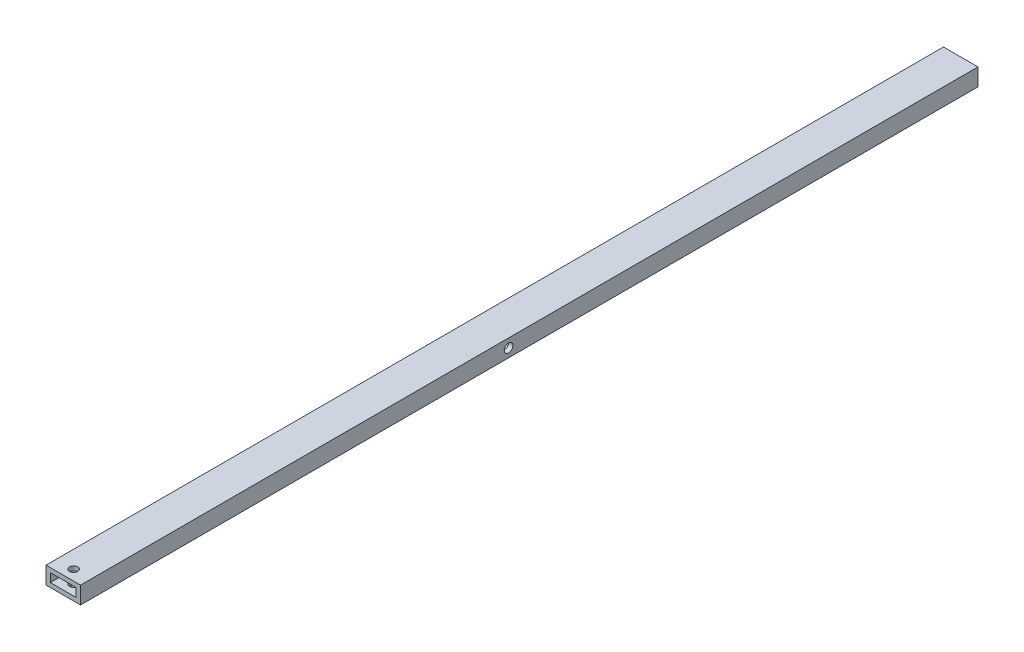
ISO-10303-21;
HEADER;
FILE_DESCRIPTION(('STEP AP214'),'2;1');
FILE_NAME('part.step','',(''),(''),'','','');
FILE_SCHEMA(('AUTOMOTIVE_DESIGN { 1 0 10303 214 1 1 1 1 }'));
ENDSEC;
DATA;
#1=APPLICATION_CONTEXT('core data for automotive mechanical design processes');
#2=APPLICATION_PROTOCOL_DEFINITION('international standard','automotive_design',2000,#1);
#3=PRODUCT_CONTEXT('',#1,'mechanical');
#4=PRODUCT('Part','Part','',(#3));
#5=PRODUCT_RELATED_PRODUCT_CATEGORY('part','',(#4));
#6=PRODUCT_DEFINITION_FORMATION('','',#4);
#7=PRODUCT_DEFINITION_CONTEXT('part definition',#1,'design');
#8=PRODUCT_DEFINITION('design','',#6,#7);
#9=PRODUCT_DEFINITION_SHAPE('','',#8);
#10=(LENGTH_UNIT() NAMED_UNIT(*) SI_UNIT(.MILLI.,.METRE.));
#11=(NAMED_UNIT(*) PLANE_ANGLE_UNIT() SI_UNIT($,.RADIAN.));
#12=(NAMED_UNIT(*) SI_UNIT($,.STERADIAN.) SOLID_ANGLE_UNIT());
#13=UNCERTAINTY_MEASURE_WITH_UNIT(LENGTH_MEASURE(1.E-05),#10,'distance_accuracy_value','');
#14=(GEOMETRIC_REPRESENTATION_CONTEXT(3) GLOBAL_UNCERTAINTY_ASSIGNED_CONTEXT((#13)) GLOBAL_UNIT_ASSIGNED_CONTEXT((#10,
#11,#12)) REPRESENTATION_CONTEXT('',''));
#15=CARTESIAN_POINT('',(0.,0.,0.));
#16=DIRECTION('',(0.,0.,1.));
#17=DIRECTION('',(1.,0.,0.));
#18=AXIS2_PLACEMENT_3D('',#15,#16,#17);
#19=CARTESIAN_POINT('',(-6.35,3.175,304.8));
#20=DIRECTION('',(1.,0.,0.));
#21=DIRECTION('',(0.,0.,-1.));
#22=AXIS2_PLACEMENT_3D('',#19,#20,#21);
#23=PLANE('',#22);
#24=CARTESIAN_POINT('',(-6.35,0.,147.32));
#25=DIRECTION('',(1.,0.,0.));
#26=DIRECTION('',(0.,1.,0.));
#27=AXIS2_PLACEMENT_3D('',#24,#25,#26);
#28=CIRCLE('',#27,1.58749999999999);
#29=CARTESIAN_POINT('',(-6.35,1.58749999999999,147.32));
#30=VERTEX_POINT('',#29);
#31=EDGE_CURVE('E210',#30,#30,#28,.T.);
#32=ORIENTED_EDGE('',*,*,#31,.T.);
#33=EDGE_LOOP('',(#32));
#34=FACE_BOUND('',#33,.T.);
#35=DIRECTION('',(0.,1.,0.));
#36=VECTOR('',#35,1.);
#37=CARTESIAN_POINT('',(-6.35,-3.175,-25.4));
#38=LINE('',#37,#36);
#39=CARTESIAN_POINT('',(-6.35,-3.175,-25.4));
#40=VERTEX_POINT('',#39);
#41=CARTESIAN_POINT('',(-6.35,3.175,-25.4));
#42=VERTEX_POINT('',#41);
#43=EDGE_CURVE('E55',#40,#42,#38,.T.);
#44=ORIENTED_EDGE('',*,*,#43,.F.);
#45=DIRECTION('',(0.,0.,-1.));
#46=VECTOR('',#45,1.);
#47=CARTESIAN_POINT('',(-6.35,-3.175,304.8));
#48=LINE('',#47,#46);
#49=CARTESIAN_POINT('',(-6.35,-3.175,304.8));
#50=VERTEX_POINT('',#49);
#51=EDGE_CURVE('E48',#50,#40,#48,.T.);
#52=ORIENTED_EDGE('',*,*,#51,.F.);
#53=DIRECTION('',(0.,-1.,0.));
#54=VECTOR('',#53,1.);
#55=CARTESIAN_POINT('',(-6.35,3.175,304.8));
#56=LINE('',#55,#54);
#57=CARTESIAN_POINT('',(-6.35,3.175,304.8));
#58=VERTEX_POINT('',#57);
#59=EDGE_CURVE('E185',#58,#50,#56,.T.);
#60=ORIENTED_EDGE('',*,*,#59,.F.);
#61=DIRECTION('',(0.,0.,-1.));
#62=VECTOR('',#61,1.);
#63=CARTESIAN_POINT('',(-6.35,3.175,304.8));
#64=LINE('',#63,#62);
#65=EDGE_CURVE('E137',#58,#42,#64,.T.);
#66=ORIENTED_EDGE('',*,*,#65,.T.);
#67=EDGE_LOOP('',(#44,#52,#60,#66));
#68=FACE_BOUND('',#67,.T.);
#69=ADVANCED_FACE('F41',(#34,#68),#23,.F.);
#70=CARTESIAN_POINT('',(-6.35,-3.175,304.8));
#71=DIRECTION('',(0.,1.,0.));
#72=DIRECTION('',(-1.,0.,0.));
#73=AXIS2_PLACEMENT_3D('',#70,#71,#72);
#74=PLANE('',#73);
#75=CARTESIAN_POINT('',(0.,-3.175,300.99));
#76=DIRECTION('',(0.,1.,0.));
#77=DIRECTION('',(0.,0.,1.));
#78=AXIS2_PLACEMENT_3D('',#75,#76,#77);
#79=CIRCLE('',#78,1.5);
#80=CARTESIAN_POINT('',(0.,-3.175,302.49));
#81=VERTEX_POINT('',#80);
#82=EDGE_CURVE('E143',#81,#81,#79,.T.);
#83=ORIENTED_EDGE('',*,*,#82,.T.);
#84=EDGE_LOOP('',(#83));
#85=FACE_BOUND('',#84,.T.);
#86=DIRECTION('',(-1.,0.,0.));
#87=VECTOR('',#86,1.);
#88=CARTESIAN_POINT('',(-6.35,-3.175,-25.4));
#89=LINE('',#88,#87);
#90=CARTESIAN_POINT('',(6.35,-3.175,-25.4));
#91=VERTEX_POINT('',#90);
#92=EDGE_CURVE('E117',#91,#40,#89,.T.);
#93=ORIENTED_EDGE('',*,*,#92,.F.);
#94=DIRECTION('',(0.,0.,-1.));
#95=VECTOR('',#94,1.);
#96=CARTESIAN_POINT('',(6.35,-3.175,304.8));
#97=LINE('',#96,#95);
#98=CARTESIAN_POINT('',(6.35,-3.175,304.8));
#99=VERTEX_POINT('',#98);
#100=EDGE_CURVE('E128',#99,#91,#97,.T.);
#101=ORIENTED_EDGE('',*,*,#100,.F.);
#102=DIRECTION('',(1.,0.,0.));
#103=VECTOR('',#102,1.);
#104=CARTESIAN_POINT('',(-6.35,-3.175,304.8));
#105=LINE('',#104,#103);
#106=EDGE_CURVE('E188',#50,#99,#105,.T.);
#107=ORIENTED_EDGE('',*,*,#106,.F.);
#108=ORIENTED_EDGE('',*,*,#51,.T.);
#109=EDGE_LOOP('',(#93,#101,#107,#108));
#110=FACE_BOUND('',#109,.T.);
#111=ADVANCED_FACE('F127',(#85,#110),#74,.F.);
#112=CARTESIAN_POINT('',(6.35,-3.175,304.8));
#113=DIRECTION('',(-1.,0.,0.));
#114=DIRECTION('',(0.,-1.,0.));
#115=AXIS2_PLACEMENT_3D('',#112,#113,#114);
#116=PLANE('',#115);
#117=CARTESIAN_POINT('',(6.35,0.,147.32));
#118=DIRECTION('',(1.,0.,0.));
#119=DIRECTION('',(0.,1.,0.));
#120=AXIS2_PLACEMENT_3D('',#117,#118,#119);
#121=CIRCLE('',#120,1.58749999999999);
#122=CARTESIAN_POINT('',(6.35,1.58749999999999,147.32));
#123=VERTEX_POINT('',#122);
#124=EDGE_CURVE('E209',#123,#123,#121,.T.);
#125=ORIENTED_EDGE('',*,*,#124,.F.);
#126=EDGE_LOOP('',(#125));
#127=FACE_BOUND('',#126,.T.);
#128=DIRECTION('',(0.,-1.,0.));
#129=VECTOR('',#128,1.);
#130=CARTESIAN_POINT('',(6.35,-3.175,-25.4));
#131=LINE('',#130,#129);
#132=CARTESIAN_POINT('',(6.35,3.175,-25.4));
#133=VERTEX_POINT('',#132);
#134=EDGE_CURVE('E114',#133,#91,#131,.T.);
#135=ORIENTED_EDGE('',*,*,#134,.F.);
#136=DIRECTION('',(0.,0.,-1.));
#137=VECTOR('',#136,1.);
#138=CARTESIAN_POINT('',(6.35,3.175,304.8));
#139=LINE('',#138,#137);
#140=CARTESIAN_POINT('',(6.35,3.175,304.8));
#141=VERTEX_POINT('',#140);
#142=EDGE_CURVE('E134',#141,#133,#139,.T.);
#143=ORIENTED_EDGE('',*,*,#142,.F.);
#144=DIRECTION('',(0.,1.,0.));
#145=VECTOR('',#144,1.);
#146=CARTESIAN_POINT('',(6.35,-3.175,304.8));
#147=LINE('',#146,#145);
#148=EDGE_CURVE('E133',#99,#141,#147,.T.);
#149=ORIENTED_EDGE('',*,*,#148,.F.);
#150=ORIENTED_EDGE('',*,*,#100,.T.);
#151=EDGE_LOOP('',(#135,#143,#149,#150));
#152=FACE_BOUND('',#151,.T.);
#153=ADVANCED_FACE('F132',(#127,#152),#116,.F.);
#154=CARTESIAN_POINT('',(6.35,3.175,304.8));
#155=DIRECTION('',(0.,-1.,0.));
#156=DIRECTION('',(0.,0.,-1.));
#157=AXIS2_PLACEMENT_3D('',#154,#155,#156);
#158=PLANE('',#157);
#159=CARTESIAN_POINT('',(0.,3.175,300.99));
#160=DIRECTION('',(0.,1.,0.));
#161=DIRECTION('',(0.,0.,1.));
#162=AXIS2_PLACEMENT_3D('',#159,#160,#161);
#163=CIRCLE('',#162,1.5);
#164=CARTESIAN_POINT('',(0.,3.175,302.49));
#165=VERTEX_POINT('',#164);
#166=EDGE_CURVE('E150',#165,#165,#163,.T.);
#167=ORIENTED_EDGE('',*,*,#166,.F.);
#168=EDGE_LOOP('',(#167));
#169=FACE_BOUND('',#168,.T.);
#170=DIRECTION('',(1.,0.,0.));
#171=VECTOR('',#170,1.);
#172=CARTESIAN_POINT('',(-6.35,3.175,-25.4));
#173=LINE('',#172,#171);
#174=EDGE_CURVE('E118',#42,#133,#173,.T.);
#175=ORIENTED_EDGE('',*,*,#174,.F.);
#176=ORIENTED_EDGE('',*,*,#65,.F.);
#177=DIRECTION('',(-1.,0.,0.));
#178=VECTOR('',#177,1.);
#179=CARTESIAN_POINT('',(6.35,3.175,304.8));
#180=LINE('',#179,#178);
#181=EDGE_CURVE('E191',#141,#58,#180,.T.);
#182=ORIENTED_EDGE('',*,*,#181,.F.);
#183=ORIENTED_EDGE('',*,*,#142,.T.);
#184=EDGE_LOOP('',(#175,#176,#182,#183));
#185=FACE_BOUND('',#184,.T.);
#186=ADVANCED_FACE('F198',(#169,#185),#158,.F.);
#187=CARTESIAN_POINT('',(-4.7625,1.5875,304.8));
#188=DIRECTION('',(1.,0.,0.));
#189=DIRECTION('',(0.,1.,0.));
#190=AXIS2_PLACEMENT_3D('',#187,#188,#189);
#191=PLANE('',#190);
#192=DIRECTION('',(0.,0.,-1.));
#193=VECTOR('',#192,1.);
#194=CARTESIAN_POINT('',(-4.7625,-1.5875,304.8));
#195=LINE('',#194,#193);
#196=CARTESIAN_POINT('',(-4.7625,-1.5875,147.32));
#197=VERTEX_POINT('',#196);
#198=CARTESIAN_POINT('',(-4.7625,-1.5875,-25.4));
#199=VERTEX_POINT('',#198);
#200=EDGE_CURVE('E181',#197,#199,#195,.T.);
#201=ORIENTED_EDGE('',*,*,#200,.T.);
#202=DIRECTION('',(0.,1.,0.));
#203=VECTOR('',#202,1.);
#204=CARTESIAN_POINT('',(-4.7625,1.5875,-25.4));
#205=LINE('',#204,#203);
#206=CARTESIAN_POINT('',(-4.7625,1.5875,-25.4));
#207=VERTEX_POINT('',#206);
#208=EDGE_CURVE('E206',#199,#207,#205,.T.);
#209=ORIENTED_EDGE('',*,*,#208,.T.);
#210=DIRECTION('',(0.,0.,-1.));
#211=VECTOR('',#210,1.);
#212=CARTESIAN_POINT('',(-4.7625,1.5875,304.8));
#213=LINE('',#212,#211);
#214=CARTESIAN_POINT('',(-4.7625,1.58749999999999,147.32));
#215=VERTEX_POINT('',#214);
#216=EDGE_CURVE('E169',#215,#207,#213,.T.);
#217=ORIENTED_EDGE('',*,*,#216,.F.);
#218=CARTESIAN_POINT('',(-4.7625,0.,147.32));
#219=DIRECTION('',(1.,0.,0.));
#220=DIRECTION('',(0.,1.,0.));
#221=AXIS2_PLACEMENT_3D('',#218,#219,#220);
#222=CIRCLE('',#221,1.58749999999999);
#223=EDGE_CURVE('E158',#197,#215,#222,.T.);
#224=ORIENTED_EDGE('',*,*,#223,.F.);
#225=EDGE_LOOP('',(#201,#209,#217,#224));
#226=FACE_BOUND('',#225,.T.);
#227=ADVANCED_FACE('F230',(#226),#191,.T.);
#228=CARTESIAN_POINT('',(-4.7625,-1.5875,304.8));
#229=DIRECTION('',(0.,1.,0.));
#230=DIRECTION('',(0.,0.,1.));
#231=AXIS2_PLACEMENT_3D('',#228,#229,#230);
#232=PLANE('',#231);
#233=CARTESIAN_POINT('',(0.,-1.5875,300.99));
#234=DIRECTION('',(0.,1.,0.));
#235=DIRECTION('',(0.,0.,1.));
#236=AXIS2_PLACEMENT_3D('',#233,#234,#235);
#237=CIRCLE('',#236,1.5);
#238=CARTESIAN_POINT('',(0.,-1.5875,302.49));
#239=VERTEX_POINT('',#238);
#240=EDGE_CURVE('E142',#239,#239,#237,.T.);
#241=ORIENTED_EDGE('',*,*,#240,.F.);
#242=EDGE_LOOP('',(#241));
#243=FACE_BOUND('',#242,.T.);
#244=DIRECTION('',(0.,0.,-1.));
#245=VECTOR('',#244,1.);
#246=CARTESIAN_POINT('',(4.76250000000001,-1.5875,304.8));
#247=LINE('',#246,#245);
#248=CARTESIAN_POINT('',(4.76250000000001,-1.5875,147.32));
#249=VERTEX_POINT('',#248);
#250=CARTESIAN_POINT('',(4.76250000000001,-1.5875,-25.4));
#251=VERTEX_POINT('',#250);
#252=EDGE_CURVE('E177',#249,#251,#247,.T.);
#253=ORIENTED_EDGE('',*,*,#252,.T.);
#254=DIRECTION('',(-1.,0.,0.));
#255=VECTOR('',#254,1.);
#256=CARTESIAN_POINT('',(-4.7625,-1.5875,-25.4));
#257=LINE('',#256,#255);
#258=EDGE_CURVE('E200',#251,#199,#257,.T.);
#259=ORIENTED_EDGE('',*,*,#258,.T.);
#260=ORIENTED_EDGE('',*,*,#200,.F.);
#261=CARTESIAN_POINT('',(-4.7625,-1.5875,304.8));
#262=VERTEX_POINT('',#261);
#263=EDGE_CURVE('E182',#262,#197,#195,.T.);
#264=ORIENTED_EDGE('',*,*,#263,.F.);
#265=DIRECTION('',(1.,0.,0.));
#266=VECTOR('',#265,1.);
#267=CARTESIAN_POINT('',(-4.7625,-1.5875,304.8));
#268=LINE('',#267,#266);
#269=CARTESIAN_POINT('',(4.76250000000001,-1.5875,304.8));
#270=VERTEX_POINT('',#269);
#271=EDGE_CURVE('E162',#262,#270,#268,.T.);
#272=ORIENTED_EDGE('',*,*,#271,.T.);
#273=EDGE_CURVE('E178',#270,#249,#247,.T.);
#274=ORIENTED_EDGE('',*,*,#273,.T.);
#275=EDGE_LOOP('',(#253,#259,#260,#264,#272,#274));
#276=FACE_BOUND('',#275,.T.);
#277=ADVANCED_FACE('F235',(#243,#276),#232,.T.);
#278=CARTESIAN_POINT('',(4.76250000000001,-1.5875,304.8));
#279=DIRECTION('',(-1.,0.,0.));
#280=DIRECTION('',(0.,-1.,0.));
#281=AXIS2_PLACEMENT_3D('',#278,#279,#280);
#282=PLANE('',#281);
#283=DIRECTION('',(0.,0.,-1.));
#284=VECTOR('',#283,1.);
#285=CARTESIAN_POINT('',(4.76250000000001,1.5875,304.8));
#286=LINE('',#285,#284);
#287=CARTESIAN_POINT('',(4.76250000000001,1.5875,147.32));
#288=VERTEX_POINT('',#287);
#289=CARTESIAN_POINT('',(4.76250000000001,1.5875,-25.4));
#290=VERTEX_POINT('',#289);
#291=EDGE_CURVE('E173',#288,#290,#286,.T.);
#292=ORIENTED_EDGE('',*,*,#291,.T.);
#293=DIRECTION('',(0.,-1.,0.));
#294=VECTOR('',#293,1.);
#295=CARTESIAN_POINT('',(4.76250000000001,-1.5875,-25.4));
#296=LINE('',#295,#294);
#297=EDGE_CURVE('E63',#290,#251,#296,.T.);
#298=ORIENTED_EDGE('',*,*,#297,.T.);
#299=ORIENTED_EDGE('',*,*,#252,.F.);
#300=CARTESIAN_POINT('',(4.76250000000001,0.,147.32));
#301=DIRECTION('',(-1.,0.,0.));
#302=DIRECTION('',(0.,-1.,0.));
#303=AXIS2_PLACEMENT_3D('',#300,#301,#302);
#304=CIRCLE('',#303,1.58749999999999);
#305=EDGE_CURVE('E213',#288,#249,#304,.T.);
#306=ORIENTED_EDGE('',*,*,#305,.F.);
#307=EDGE_LOOP('',(#292,#298,#299,#306));
#308=FACE_BOUND('',#307,.T.);
#309=ADVANCED_FACE('F249',(#308),#282,.T.);
#310=CARTESIAN_POINT('',(4.76250000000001,1.5875,304.8));
#311=DIRECTION('',(0.,-1.,0.));
#312=DIRECTION('',(0.,0.,-1.));
#313=AXIS2_PLACEMENT_3D('',#310,#311,#312);
#314=PLANE('',#313);
#315=CARTESIAN_POINT('',(0.,1.5875,300.99));
#316=DIRECTION('',(0.,-1.,0.));
#317=DIRECTION('',(0.,0.,-1.));
#318=AXIS2_PLACEMENT_3D('',#315,#316,#317);
#319=CIRCLE('',#318,1.5);
#320=CARTESIAN_POINT('',(0.,1.5875,299.49));
#321=VERTEX_POINT('',#320);
#322=EDGE_CURVE('E140',#321,#321,#319,.T.);
#323=ORIENTED_EDGE('',*,*,#322,.F.);
#324=EDGE_LOOP('',(#323));
#325=FACE_BOUND('',#324,.T.);
#326=ORIENTED_EDGE('',*,*,#216,.T.);
#327=DIRECTION('',(1.,0.,0.));
#328=VECTOR('',#327,1.);
#329=CARTESIAN_POINT('',(4.76250000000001,1.5875,-25.4));
#330=LINE('',#329,#328);
#331=EDGE_CURVE('E11',#207,#290,#330,.T.);
#332=ORIENTED_EDGE('',*,*,#331,.T.);
#333=ORIENTED_EDGE('',*,*,#291,.F.);
#334=CARTESIAN_POINT('',(4.76250000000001,1.5875,304.8));
#335=VERTEX_POINT('',#334);
#336=EDGE_CURVE('E174',#335,#288,#286,.T.);
#337=ORIENTED_EDGE('',*,*,#336,.F.);
#338=DIRECTION('',(-1.,0.,0.));
#339=VECTOR('',#338,1.);
#340=CARTESIAN_POINT('',(4.76250000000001,1.5875,304.8));
#341=LINE('',#340,#339);
#342=CARTESIAN_POINT('',(-4.7625,1.5875,304.8));
#343=VERTEX_POINT('',#342);
#344=EDGE_CURVE('E167',#335,#343,#341,.T.);
#345=ORIENTED_EDGE('',*,*,#344,.T.);
#346=EDGE_CURVE('E170',#343,#215,#213,.T.);
#347=ORIENTED_EDGE('',*,*,#346,.T.);
#348=EDGE_LOOP('',(#326,#332,#333,#337,#345,#347));
#349=FACE_BOUND('',#348,.T.);
#350=ADVANCED_FACE('F252',(#325,#349),#314,.T.);
#351=EDGE_CURVE('E155',#215,#197,#222,.T.);
#352=ORIENTED_EDGE('',*,*,#351,.F.);
#353=ORIENTED_EDGE('',*,*,#346,.F.);
#354=DIRECTION('',(0.,-1.,0.));
#355=VECTOR('',#354,1.);
#356=CARTESIAN_POINT('',(-4.7625,1.5875,304.8));
#357=LINE('',#356,#355);
#358=EDGE_CURVE('E147',#343,#262,#357,.T.);
#359=ORIENTED_EDGE('',*,*,#358,.T.);
#360=ORIENTED_EDGE('',*,*,#263,.T.);
#361=EDGE_LOOP('',(#352,#353,#359,#360));
#362=FACE_BOUND('',#361,.T.);
#363=ADVANCED_FACE('F237',(#362),#191,.T.);
#364=EDGE_CURVE('E215',#249,#288,#304,.T.);
#365=ORIENTED_EDGE('',*,*,#364,.F.);
#366=ORIENTED_EDGE('',*,*,#273,.F.);
#367=DIRECTION('',(0.,1.,0.));
#368=VECTOR('',#367,1.);
#369=CARTESIAN_POINT('',(4.76250000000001,-1.5875,304.8));
#370=LINE('',#369,#368);
#371=EDGE_CURVE('E164',#270,#335,#370,.T.);
#372=ORIENTED_EDGE('',*,*,#371,.T.);
#373=ORIENTED_EDGE('',*,*,#336,.T.);
#374=EDGE_LOOP('',(#365,#366,#372,#373));
#375=FACE_BOUND('',#374,.T.);
#376=ADVANCED_FACE('F245',(#375),#282,.T.);
#377=CARTESIAN_POINT('',(0.,0.,304.8));
#378=DIRECTION('',(0.,0.,1.));
#379=DIRECTION('',(1.,0.,0.));
#380=AXIS2_PLACEMENT_3D('',#377,#378,#379);
#381=PLANE('',#380);
#382=ORIENTED_EDGE('',*,*,#59,.T.);
#383=ORIENTED_EDGE('',*,*,#106,.T.);
#384=ORIENTED_EDGE('',*,*,#148,.T.);
#385=ORIENTED_EDGE('',*,*,#181,.T.);
#386=EDGE_LOOP('',(#382,#383,#384,#385));
#387=FACE_BOUND('',#386,.T.);
#388=ORIENTED_EDGE('',*,*,#271,.F.);
#389=ORIENTED_EDGE('',*,*,#358,.F.);
#390=ORIENTED_EDGE('',*,*,#344,.F.);
#391=ORIENTED_EDGE('',*,*,#371,.F.);
#392=EDGE_LOOP('',(#388,#389,#390,#391));
#393=FACE_BOUND('',#392,.T.);
#394=ADVANCED_FACE('F241',(#387,#393),#381,.T.);
#395=CARTESIAN_POINT('',(0.,-3.175,300.99));
#396=DIRECTION('',(0.,1.,0.));
#397=DIRECTION('',(0.,0.,1.));
#398=AXIS2_PLACEMENT_3D('',#395,#396,#397);
#399=CYLINDRICAL_SURFACE('',#398,1.5);
#400=ORIENTED_EDGE('',*,*,#322,.T.);
#401=EDGE_LOOP('',(#400));
#402=FACE_BOUND('',#401,.T.);
#403=ORIENTED_EDGE('',*,*,#166,.T.);
#404=EDGE_LOOP('',(#403));
#405=FACE_BOUND('',#404,.T.);
#406=ADVANCED_FACE('F277',(#402,#405),#399,.F.);
#407=ORIENTED_EDGE('',*,*,#240,.T.);
#408=EDGE_LOOP('',(#407));
#409=FACE_BOUND('',#408,.T.);
#410=ORIENTED_EDGE('',*,*,#82,.F.);
#411=EDGE_LOOP('',(#410));
#412=FACE_BOUND('',#411,.T.);
#413=ADVANCED_FACE('F290',(#409,#412),#399,.F.);
#414=CARTESIAN_POINT('',(-6.35,0.,147.32));
#415=DIRECTION('',(1.,0.,0.));
#416=DIRECTION('',(0.,1.,0.));
#417=AXIS2_PLACEMENT_3D('',#414,#415,#416);
#418=CYLINDRICAL_SURFACE('',#417,1.58749999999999);
#419=ORIENTED_EDGE('',*,*,#364,.T.);
#420=ORIENTED_EDGE('',*,*,#305,.T.);
#421=EDGE_LOOP('',(#419,#420));
#422=FACE_BOUND('',#421,.T.);
#423=ORIENTED_EDGE('',*,*,#124,.T.);
#424=EDGE_LOOP('',(#423));
#425=FACE_BOUND('',#424,.T.);
#426=ADVANCED_FACE('F258',(#422,#425),#418,.F.);
#427=ORIENTED_EDGE('',*,*,#351,.T.);
#428=ORIENTED_EDGE('',*,*,#223,.T.);
#429=EDGE_LOOP('',(#427,#428));
#430=FACE_BOUND('',#429,.T.);
#431=ORIENTED_EDGE('',*,*,#31,.F.);
#432=EDGE_LOOP('',(#431));
#433=FACE_BOUND('',#432,.T.);
#434=ADVANCED_FACE('F222',(#430,#433),#418,.F.);
#435=CARTESIAN_POINT('',(0.,0.,-25.4));
#436=DIRECTION('',(0.,0.,-1.));
#437=DIRECTION('',(-1.,0.,0.));
#438=AXIS2_PLACEMENT_3D('',#435,#436,#437);
#439=PLANE('',#438);
#440=ORIENTED_EDGE('',*,*,#258,.F.);
#441=ORIENTED_EDGE('',*,*,#297,.F.);
#442=ORIENTED_EDGE('',*,*,#331,.F.);
#443=ORIENTED_EDGE('',*,*,#208,.F.);
#444=EDGE_LOOP('',(#440,#441,#442,#443));
#445=FACE_BOUND('',#444,.T.);
#446=ORIENTED_EDGE('',*,*,#134,.T.);
#447=ORIENTED_EDGE('',*,*,#92,.T.);
#448=ORIENTED_EDGE('',*,*,#43,.T.);
#449=ORIENTED_EDGE('',*,*,#174,.T.);
#450=EDGE_LOOP('',(#446,#447,#448,#449));
#451=FACE_BOUND('',#450,.T.);
#452=ADVANCED_FACE('F116',(#445,#451),#439,.T.);
#453=CLOSED_SHELL('',(#69,#111,#153,#186,#227,#277,#309,#350,#363,#376,#394,#406,#413,#426,#434,#452));
#454=MANIFOLD_SOLID_BREP('B2',#453);
#455=ADVANCED_BREP_SHAPE_REPRESENTATION('',(#18,#454),#14);
#456=SHAPE_DEFINITION_REPRESENTATION(#9,#455);
ENDSEC;
END-ISO-10303-21;
